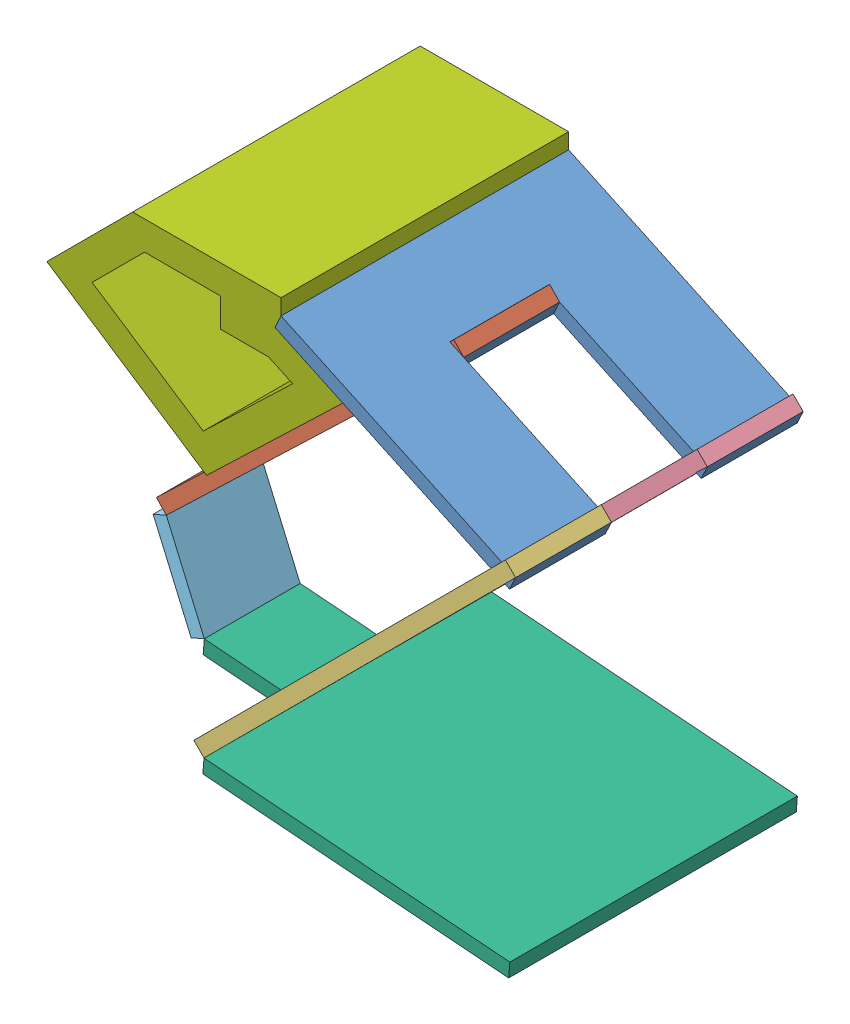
SolidWorks assembly leg.SLDASM, configuration Default (file format 13000). Lengths in mm.
Overall size (48.9 49.59 30).
7 component instances, 7 part files, 18 mates.
Components (placement in the parent):
- A-1: A.SLDPRT [Default] at (36.0487 -13.3125 0) x (0.906308 -0.422618 0) z (0 0 -1) size (27 1.5 30)
- D-1: D.SLDPRT [Default] at (1.0489 -19.111 0) x (-0.721592 -0.692319 0) z (0 0 -1) size (43 1.5 10)
- E1-1: E1.SLDPRT [Default] at (28.7903 -14.5947 0) x (-0.706665 -0.707548 0) z (0 0 -1) size (46 1.5 10)
- E2-1: E2.SLDPRT [Default] at (28.7903 -14.5947 0) x (-0.706665 -0.707548 0) z (0 0 -1) size (46 1.5 10)
- F-1: F.SLDPRT [Default] at (-22.9783 -14.253 0) x (0.395949 -0.918273 0) z (0 0 -1) size (10 1.5 10)
- G-1: G.SLDPRT [Default] at (-41.9101 -40.7239 0) x (0.996959 -0.077928 0) z (0 0 -1) size (42 1.5 30)
- payload-1: payload.SLDPRT [Default] at origin size (30.88 19.93 30)
Mates (geometry in assembly coordinates):
- Coincident1: coincident aligned: line of D-1 through (16.5631 -4.2262 -5) axis (0 0 1); line of A-1 through (16.5631 -4.2262 -5) axis (0 0 1)
- Coincident2: coincident anti-aligned: plane of D-1 through (4.3029 -16.0028 5) normal (0 0 1); plane of A-1 through (16.5673 -4.2171 5) normal (0 0 -1)
- Coincident3: coincident aligned: line of E1-1 through (31.9703 -11.4107 15) axis (0 0 -1); line of A-1 through (31.9703 -11.4107 15) axis (0 0 -1)
- Coincident4: coincident aligned: plane of A-1 through (35.4148 -14.6719 15) normal (0 0 1); plane of E1-1 through (27.729 -13.5347 15) normal (0 0 1)
- Coincident6: coincident aligned: plane of A-1 through (35.4148 -14.6719 -15) normal (0 0 -1); plane of E2-1 through (27.729 -13.5347 -15) normal (0 0 -1)
- Coincident7: coincident aligned: line of E2-1 through (31.9703 -11.4107 -5) axis (0 0 -1); line of A-1 through (31.9703 -11.4107 -5) axis (0 0 -1)
- Coincident8: coincident: point of D-1; moEndPointRef_w of F-1
- Coincident9: coincident aligned: plane of D-1 through (4.3029 -16.0028 5) normal (0 0 1); plane of F-1 through (-10.4967 -43.1747 5) normal (0 0 1)
- Coincident10: coincident aligned: line of G-1 through (-10.5059 -43.1786 5) axis (0 0 -1); line of F-1 through (-10.5059 -43.1786 5) axis (0 0 -1)
- Coincident11: coincident aligned: plane of F-1 through (-10.4967 -43.1747 5) normal (0 0 1); plane of G-1 through (-10.5051 -43.1686 5) normal (0 0 1)
- Coincident12: coincident: plane of E1-1 through (28.7903 -14.5947 0) normal (0.707548 -0.706665 0); line of G-1 through (-0.5363 -43.9579 15) axis (0 0 -1)
- Coincident13: coincident aligned: line of E2-1 through (-0.5363 -43.9579 -5) axis (0 0 -1); line of G-1 through (-0.5363 -43.9579 -5) axis (0 0 -1)
- Coincident15: coincident: unknown of A-1
- Coincident34: coordinate: unknown of payload-1
- Coincident35: coincident anti-aligned: plane of A-1 through (35.4148 -14.6719 0) normal (-0.422618 -0.906308 0); plane of payload-1 through (0.7056 1.5132 15) normal (0.422618 0.906308 0)
- Coincident36: coincident aligned: plane of A-1 through (35.4148 -14.6719 -15) normal (0 0 -1); plane of payload-1 through (0 0 -15) normal (0 0 -1)
- Coincident37: coincident aligned: plane of A-1 through (36.0487 -13.3125 0) normal (0.422618 0.906308 0); plane of D-1
- Coincident19: coincident: plane of D-1 through (1.0489 -19.111 0) normal (0.692319 -0.721592 0); line of payload-1 through (20 16.5631 -4.2262) axis (0 -0.721592 -0.692319)
